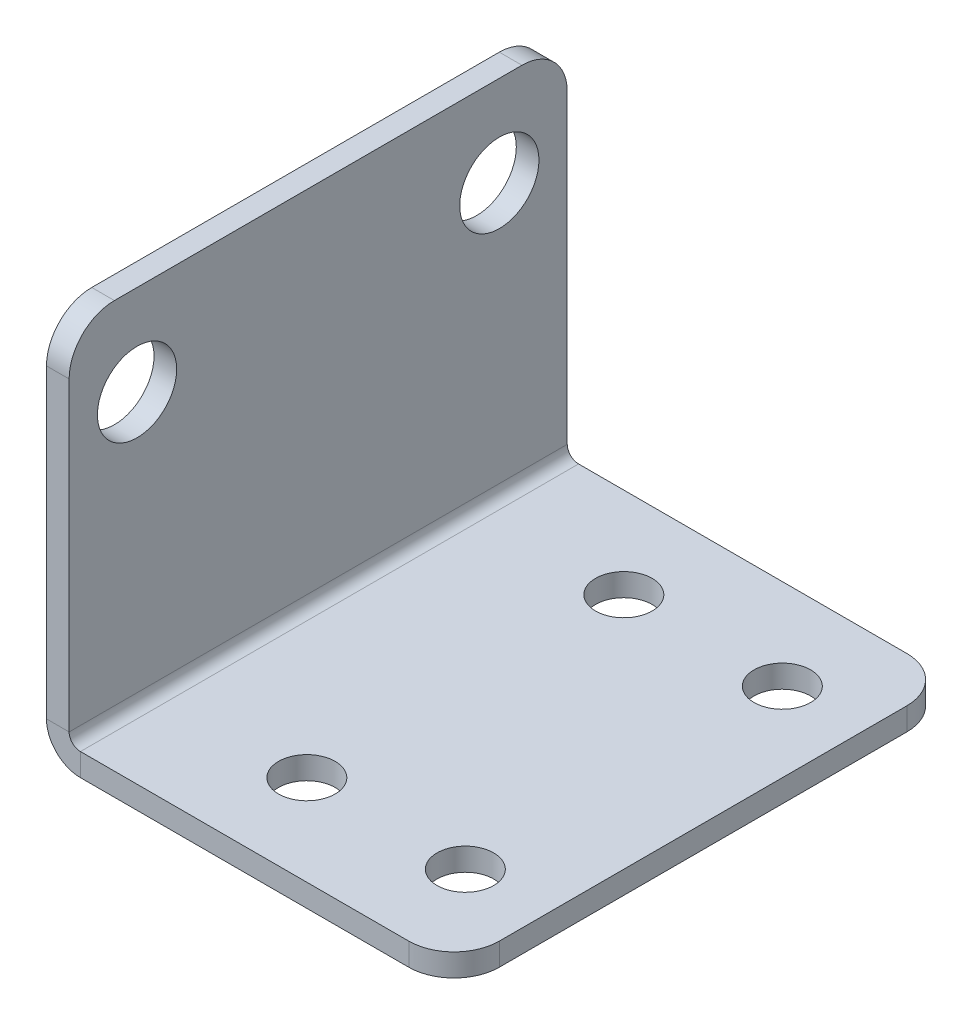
ISO-10303-21;
HEADER;
FILE_DESCRIPTION(('STEP AP214'),'2;1');
FILE_NAME('part.step','',(''),(''),'','','');
FILE_SCHEMA(('AUTOMOTIVE_DESIGN { 1 0 10303 214 1 1 1 1 }'));
ENDSEC;
DATA;
#1=APPLICATION_CONTEXT('core data for automotive mechanical design processes');
#2=APPLICATION_PROTOCOL_DEFINITION('international standard','automotive_design',2000,#1);
#3=PRODUCT_CONTEXT('',#1,'mechanical');
#4=PRODUCT('Part','Part','',(#3));
#5=PRODUCT_RELATED_PRODUCT_CATEGORY('part','',(#4));
#6=PRODUCT_DEFINITION_FORMATION('','',#4);
#7=PRODUCT_DEFINITION_CONTEXT('part definition',#1,'design');
#8=PRODUCT_DEFINITION('design','',#6,#7);
#9=PRODUCT_DEFINITION_SHAPE('','',#8);
#10=(LENGTH_UNIT() NAMED_UNIT(*) SI_UNIT(.MILLI.,.METRE.));
#11=(NAMED_UNIT(*) PLANE_ANGLE_UNIT() SI_UNIT($,.RADIAN.));
#12=(NAMED_UNIT(*) SI_UNIT($,.STERADIAN.) SOLID_ANGLE_UNIT());
#13=UNCERTAINTY_MEASURE_WITH_UNIT(LENGTH_MEASURE(1.E-05),#10,'distance_accuracy_value','');
#14=(GEOMETRIC_REPRESENTATION_CONTEXT(3) GLOBAL_UNCERTAINTY_ASSIGNED_CONTEXT((#13)) GLOBAL_UNIT_ASSIGNED_CONTEXT((#10,
#11,#12)) REPRESENTATION_CONTEXT('',''));
#15=CARTESIAN_POINT('',(0.,0.,0.));
#16=DIRECTION('',(0.,0.,1.));
#17=DIRECTION('',(1.,0.,0.));
#18=AXIS2_PLACEMENT_3D('',#15,#16,#17);
#19=CARTESIAN_POINT('',(0.5,0.,11.));
#20=DIRECTION('',(0.,0.,1.));
#21=DIRECTION('',(1.,0.,0.));
#22=AXIS2_PLACEMENT_3D('',#19,#20,#21);
#23=PLANE('',#22);
#24=DIRECTION('',(0.,-1.,0.));
#25=VECTOR('',#24,1.);
#26=CARTESIAN_POINT('',(0.5,0.,11.));
#27=LINE('',#26,#25);
#28=CARTESIAN_POINT('',(0.5,0.,11.));
#29=VERTEX_POINT('',#28);
#30=CARTESIAN_POINT('',(0.5,-1.,11.));
#31=VERTEX_POINT('',#30);
#32=EDGE_CURVE('E128',#29,#31,#27,.T.);
#33=ORIENTED_EDGE('',*,*,#32,.F.);
#34=CARTESIAN_POINT('',(0.5,0.5,11.));
#35=DIRECTION('',(0.,0.,-1.));
#36=DIRECTION('',(-1.,0.,0.));
#37=AXIS2_PLACEMENT_3D('',#34,#35,#36);
#38=CIRCLE('',#37,0.5);
#39=CARTESIAN_POINT('',(0.,0.5,11.));
#40=VERTEX_POINT('',#39);
#41=EDGE_CURVE('E132',#40,#29,#38,.F.);
#42=ORIENTED_EDGE('',*,*,#41,.F.);
#43=DIRECTION('',(1.,0.,0.));
#44=VECTOR('',#43,1.);
#45=CARTESIAN_POINT('',(-1.,0.500000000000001,11.));
#46=LINE('',#45,#44);
#47=CARTESIAN_POINT('',(-1.,0.500000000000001,11.));
#48=VERTEX_POINT('',#47);
#49=EDGE_CURVE('E140',#48,#40,#46,.T.);
#50=ORIENTED_EDGE('',*,*,#49,.F.);
#51=CARTESIAN_POINT('',(0.5,0.5,11.));
#52=DIRECTION('',(0.,0.,1.));
#53=DIRECTION('',(1.,0.,0.));
#54=AXIS2_PLACEMENT_3D('',#51,#52,#53);
#55=CIRCLE('',#54,1.5);
#56=EDGE_CURVE('E134',#48,#31,#55,.T.);
#57=ORIENTED_EDGE('',*,*,#56,.T.);
#58=EDGE_LOOP('',(#33,#42,#50,#57));
#59=FACE_BOUND('',#58,.T.);
#60=ADVANCED_FACE('F38',(#59),#23,.T.);
#61=CARTESIAN_POINT('',(-1.,0.500000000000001,11.));
#62=DIRECTION('',(0.,0.,1.));
#63=DIRECTION('',(1.,0.,0.));
#64=AXIS2_PLACEMENT_3D('',#61,#62,#63);
#65=PLANE('',#64);
#66=DIRECTION('',(1.,0.,0.));
#67=VECTOR('',#66,1.);
#68=CARTESIAN_POINT('',(0.,-1.,11.));
#69=LINE('',#68,#67);
#70=CARTESIAN_POINT('',(15.,-1.,11.));
#71=VERTEX_POINT('',#70);
#72=EDGE_CURVE('E162',#31,#71,#69,.T.);
#73=ORIENTED_EDGE('',*,*,#72,.T.);
#74=DIRECTION('',(0.,-1.,0.));
#75=VECTOR('',#74,1.);
#76=CARTESIAN_POINT('',(15.,0.500000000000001,11.));
#77=LINE('',#76,#75);
#78=CARTESIAN_POINT('',(15.,0.,11.));
#79=VERTEX_POINT('',#78);
#80=EDGE_CURVE('E161',#71,#79,#77,.F.);
#81=ORIENTED_EDGE('',*,*,#80,.T.);
#82=DIRECTION('',(1.,0.,0.));
#83=VECTOR('',#82,1.);
#84=CARTESIAN_POINT('',(0.,0.,11.));
#85=LINE('',#84,#83);
#86=EDGE_CURVE('E149',#29,#79,#85,.T.);
#87=ORIENTED_EDGE('',*,*,#86,.F.);
#88=ORIENTED_EDGE('',*,*,#32,.T.);
#89=EDGE_LOOP('',(#73,#81,#87,#88));
#90=FACE_BOUND('',#89,.T.);
#91=ADVANCED_FACE('F159',(#90),#65,.T.);
#92=CARTESIAN_POINT('',(0.,0.5,-11.));
#93=DIRECTION('',(0.,0.,-1.));
#94=DIRECTION('',(-1.,0.,0.));
#95=AXIS2_PLACEMENT_3D('',#92,#93,#94);
#96=PLANE('',#95);
#97=DIRECTION('',(-1.,0.,0.));
#98=VECTOR('',#97,1.);
#99=CARTESIAN_POINT('',(0.,0.5,-11.));
#100=LINE('',#99,#98);
#101=CARTESIAN_POINT('',(0.,0.5,-11.));
#102=VERTEX_POINT('',#101);
#103=CARTESIAN_POINT('',(-1.,0.500000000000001,-11.));
#104=VERTEX_POINT('',#103);
#105=EDGE_CURVE('E206',#102,#104,#100,.T.);
#106=ORIENTED_EDGE('',*,*,#105,.F.);
#107=CARTESIAN_POINT('',(0.5,0.5,-11.));
#108=DIRECTION('',(0.,0.,-1.));
#109=DIRECTION('',(-1.,0.,0.));
#110=AXIS2_PLACEMENT_3D('',#107,#108,#109);
#111=CIRCLE('',#110,0.5);
#112=CARTESIAN_POINT('',(0.5,0.,-11.));
#113=VERTEX_POINT('',#112);
#114=EDGE_CURVE('E181',#102,#113,#111,.F.);
#115=ORIENTED_EDGE('',*,*,#114,.T.);
#116=DIRECTION('',(0.,1.,0.));
#117=VECTOR('',#116,1.);
#118=CARTESIAN_POINT('',(0.5,-1.,-11.));
#119=LINE('',#118,#117);
#120=CARTESIAN_POINT('',(0.5,-1.,-11.));
#121=VERTEX_POINT('',#120);
#122=EDGE_CURVE('E204',#121,#113,#119,.T.);
#123=ORIENTED_EDGE('',*,*,#122,.F.);
#124=CARTESIAN_POINT('',(0.5,0.5,-11.));
#125=DIRECTION('',(0.,0.,1.));
#126=DIRECTION('',(1.,0.,0.));
#127=AXIS2_PLACEMENT_3D('',#124,#125,#126);
#128=CIRCLE('',#127,1.5);
#129=EDGE_CURVE('E187',#104,#121,#128,.T.);
#130=ORIENTED_EDGE('',*,*,#129,.F.);
#131=EDGE_LOOP('',(#106,#115,#123,#130));
#132=FACE_BOUND('',#131,.T.);
#133=ADVANCED_FACE('F333',(#132),#96,.T.);
#134=CARTESIAN_POINT('',(0.5,-1.,-11.));
#135=DIRECTION('',(0.,0.,-1.));
#136=DIRECTION('',(-1.,0.,0.));
#137=AXIS2_PLACEMENT_3D('',#134,#135,#136);
#138=PLANE('',#137);
#139=DIRECTION('',(0.,-1.,0.));
#140=VECTOR('',#139,1.);
#141=CARTESIAN_POINT('',(-1.,16.,-11.));
#142=LINE('',#141,#140);
#143=CARTESIAN_POINT('',(-1.,14.,-11.));
#144=VERTEX_POINT('',#143);
#145=EDGE_CURVE('E185',#144,#104,#142,.T.);
#146=ORIENTED_EDGE('',*,*,#145,.F.);
#147=DIRECTION('',(1.,0.,0.));
#148=VECTOR('',#147,1.);
#149=CARTESIAN_POINT('',(0.5,14.,-11.));
#150=LINE('',#149,#148);
#151=CARTESIAN_POINT('',(0.,14.,-11.));
#152=VERTEX_POINT('',#151);
#153=EDGE_CURVE('E232',#144,#152,#150,.T.);
#154=ORIENTED_EDGE('',*,*,#153,.T.);
#155=DIRECTION('',(0.,-1.,0.));
#156=VECTOR('',#155,1.);
#157=CARTESIAN_POINT('',(0.,16.,-11.));
#158=LINE('',#157,#156);
#159=EDGE_CURVE('E183',#152,#102,#158,.T.);
#160=ORIENTED_EDGE('',*,*,#159,.T.);
#161=ORIENTED_EDGE('',*,*,#105,.T.);
#162=EDGE_LOOP('',(#146,#154,#160,#161));
#163=FACE_BOUND('',#162,.T.);
#164=ADVANCED_FACE('F252',(#163),#138,.T.);
#165=CARTESIAN_POINT('',(0.,-1.,11.));
#166=DIRECTION('',(0.,1.,0.));
#167=DIRECTION('',(0.,0.,1.));
#168=AXIS2_PLACEMENT_3D('',#165,#166,#167);
#169=PLANE('',#168);
#170=CARTESIAN_POINT('',(6.5,-1.,-7.));
#171=DIRECTION('',(0.,1.,0.));
#172=DIRECTION('',(0.,0.,1.));
#173=AXIS2_PLACEMENT_3D('',#170,#171,#172);
#174=CIRCLE('',#173,1.24999999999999);
#175=CARTESIAN_POINT('',(6.5,-1.,-5.75000000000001));
#176=VERTEX_POINT('',#175);
#177=EDGE_CURVE('E290',#176,#176,#174,.T.);
#178=ORIENTED_EDGE('',*,*,#177,.T.);
#179=EDGE_LOOP('',(#178));
#180=FACE_BOUND('',#179,.T.);
#181=CARTESIAN_POINT('',(13.5,-1.,-7.));
#182=DIRECTION('',(0.,1.,0.));
#183=DIRECTION('',(0.,0.,1.));
#184=AXIS2_PLACEMENT_3D('',#181,#182,#183);
#185=CIRCLE('',#184,1.24999999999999);
#186=CARTESIAN_POINT('',(13.5,-1.,-5.75000000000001));
#187=VERTEX_POINT('',#186);
#188=EDGE_CURVE('E284',#187,#187,#185,.T.);
#189=ORIENTED_EDGE('',*,*,#188,.T.);
#190=EDGE_LOOP('',(#189));
#191=FACE_BOUND('',#190,.T.);
#192=CARTESIAN_POINT('',(6.5,-1.,7.));
#193=DIRECTION('',(0.,1.,0.));
#194=DIRECTION('',(0.,0.,1.));
#195=AXIS2_PLACEMENT_3D('',#192,#193,#194);
#196=CIRCLE('',#195,1.24999999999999);
#197=CARTESIAN_POINT('',(6.5,-1.,8.24999999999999));
#198=VERTEX_POINT('',#197);
#199=EDGE_CURVE('E278',#198,#198,#196,.T.);
#200=ORIENTED_EDGE('',*,*,#199,.T.);
#201=EDGE_LOOP('',(#200));
#202=FACE_BOUND('',#201,.T.);
#203=CARTESIAN_POINT('',(13.5,-1.,7.));
#204=DIRECTION('',(0.,1.,0.));
#205=DIRECTION('',(0.,0.,1.));
#206=AXIS2_PLACEMENT_3D('',#203,#204,#205);
#207=CIRCLE('',#206,1.24999999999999);
#208=CARTESIAN_POINT('',(13.5,-1.,8.24999999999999));
#209=VERTEX_POINT('',#208);
#210=EDGE_CURVE('E179',#209,#209,#207,.T.);
#211=ORIENTED_EDGE('',*,*,#210,.T.);
#212=EDGE_LOOP('',(#211));
#213=FACE_BOUND('',#212,.T.);
#214=DIRECTION('',(1.,0.,0.));
#215=VECTOR('',#214,1.);
#216=CARTESIAN_POINT('',(0.,-1.,-11.));
#217=LINE('',#216,#215);
#218=CARTESIAN_POINT('',(15.,-1.,-11.));
#219=VERTEX_POINT('',#218);
#220=EDGE_CURVE('E176',#121,#219,#217,.T.);
#221=ORIENTED_EDGE('',*,*,#220,.T.);
#222=CARTESIAN_POINT('',(15.,-1.,-9.));
#223=DIRECTION('',(0.,1.,0.));
#224=DIRECTION('',(0.,0.,1.));
#225=AXIS2_PLACEMENT_3D('',#222,#223,#224);
#226=CIRCLE('',#225,2.);
#227=CARTESIAN_POINT('',(17.,-1.,-9.));
#228=VERTEX_POINT('',#227);
#229=EDGE_CURVE('E220',#219,#228,#226,.F.);
#230=ORIENTED_EDGE('',*,*,#229,.T.);
#231=DIRECTION('',(0.,0.,-1.));
#232=VECTOR('',#231,1.);
#233=CARTESIAN_POINT('',(17.,-1.,11.));
#234=LINE('',#233,#232);
#235=CARTESIAN_POINT('',(17.,-1.,9.));
#236=VERTEX_POINT('',#235);
#237=EDGE_CURVE('E201',#236,#228,#234,.T.);
#238=ORIENTED_EDGE('',*,*,#237,.F.);
#239=CARTESIAN_POINT('',(15.,-1.,9.));
#240=DIRECTION('',(0.,1.,0.));
#241=DIRECTION('',(0.,0.,1.));
#242=AXIS2_PLACEMENT_3D('',#239,#240,#241);
#243=CIRCLE('',#242,2.);
#244=EDGE_CURVE('E218',#236,#71,#243,.F.);
#245=ORIENTED_EDGE('',*,*,#244,.T.);
#246=ORIENTED_EDGE('',*,*,#72,.F.);
#247=DIRECTION('',(0.,0.,-1.));
#248=VECTOR('',#247,1.);
#249=CARTESIAN_POINT('',(0.5,-1.,11.));
#250=LINE('',#249,#248);
#251=EDGE_CURVE('E175',#31,#121,#250,.T.);
#252=ORIENTED_EDGE('',*,*,#251,.T.);
#253=EDGE_LOOP('',(#221,#230,#238,#245,#246,#252));
#254=FACE_BOUND('',#253,.T.);
#255=ADVANCED_FACE('F270',(#180,#191,#202,#213,#254),#169,.F.);
#256=CARTESIAN_POINT('',(17.,0.,11.));
#257=DIRECTION('',(1.,0.,0.));
#258=DIRECTION('',(0.,0.,-1.));
#259=AXIS2_PLACEMENT_3D('',#256,#257,#258);
#260=PLANE('',#259);
#261=ORIENTED_EDGE('',*,*,#237,.T.);
#262=DIRECTION('',(0.,-1.,0.));
#263=VECTOR('',#262,1.);
#264=CARTESIAN_POINT('',(17.,0.,-9.));
#265=LINE('',#264,#263);
#266=CARTESIAN_POINT('',(17.,0.,-9.));
#267=VERTEX_POINT('',#266);
#268=EDGE_CURVE('E225',#228,#267,#265,.F.);
#269=ORIENTED_EDGE('',*,*,#268,.T.);
#270=DIRECTION('',(0.,0.,-1.));
#271=VECTOR('',#270,1.);
#272=CARTESIAN_POINT('',(17.,0.,11.));
#273=LINE('',#272,#271);
#274=CARTESIAN_POINT('',(17.,0.,9.));
#275=VERTEX_POINT('',#274);
#276=EDGE_CURVE('E156',#275,#267,#273,.T.);
#277=ORIENTED_EDGE('',*,*,#276,.F.);
#278=DIRECTION('',(0.,-1.,0.));
#279=VECTOR('',#278,1.);
#280=CARTESIAN_POINT('',(17.,0.,9.));
#281=LINE('',#280,#279);
#282=EDGE_CURVE('E222',#275,#236,#281,.T.);
#283=ORIENTED_EDGE('',*,*,#282,.T.);
#284=EDGE_LOOP('',(#261,#269,#277,#283));
#285=FACE_BOUND('',#284,.T.);
#286=ADVANCED_FACE('F422',(#285),#260,.T.);
#287=CARTESIAN_POINT('',(0.,0.,11.));
#288=DIRECTION('',(0.,1.,0.));
#289=DIRECTION('',(0.,0.,1.));
#290=AXIS2_PLACEMENT_3D('',#287,#288,#289);
#291=PLANE('',#290);
#292=CARTESIAN_POINT('',(6.5,0.,-7.));
#293=DIRECTION('',(0.,1.,0.));
#294=DIRECTION('',(0.,0.,1.));
#295=AXIS2_PLACEMENT_3D('',#292,#293,#294);
#296=CIRCLE('',#295,1.24999999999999);
#297=CARTESIAN_POINT('',(6.5,0.,-5.75000000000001));
#298=VERTEX_POINT('',#297);
#299=EDGE_CURVE('E293',#298,#298,#296,.T.);
#300=ORIENTED_EDGE('',*,*,#299,.F.);
#301=EDGE_LOOP('',(#300));
#302=FACE_BOUND('',#301,.T.);
#303=CARTESIAN_POINT('',(13.5,0.,-7.));
#304=DIRECTION('',(0.,1.,0.));
#305=DIRECTION('',(0.,0.,1.));
#306=AXIS2_PLACEMENT_3D('',#303,#304,#305);
#307=CIRCLE('',#306,1.24999999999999);
#308=CARTESIAN_POINT('',(13.5,0.,-5.75000000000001));
#309=VERTEX_POINT('',#308);
#310=EDGE_CURVE('E287',#309,#309,#307,.T.);
#311=ORIENTED_EDGE('',*,*,#310,.F.);
#312=EDGE_LOOP('',(#311));
#313=FACE_BOUND('',#312,.T.);
#314=CARTESIAN_POINT('',(6.5,0.,7.));
#315=DIRECTION('',(0.,1.,0.));
#316=DIRECTION('',(0.,0.,1.));
#317=AXIS2_PLACEMENT_3D('',#314,#315,#316);
#318=CIRCLE('',#317,1.24999999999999);
#319=CARTESIAN_POINT('',(6.5,0.,8.24999999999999));
#320=VERTEX_POINT('',#319);
#321=EDGE_CURVE('E281',#320,#320,#318,.T.);
#322=ORIENTED_EDGE('',*,*,#321,.F.);
#323=EDGE_LOOP('',(#322));
#324=FACE_BOUND('',#323,.T.);
#325=CARTESIAN_POINT('',(13.5,0.,7.));
#326=DIRECTION('',(0.,1.,0.));
#327=DIRECTION('',(0.,0.,1.));
#328=AXIS2_PLACEMENT_3D('',#325,#326,#327);
#329=CIRCLE('',#328,1.24999999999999);
#330=CARTESIAN_POINT('',(13.5,0.,8.24999999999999));
#331=VERTEX_POINT('',#330);
#332=EDGE_CURVE('E275',#331,#331,#329,.T.);
#333=ORIENTED_EDGE('',*,*,#332,.F.);
#334=EDGE_LOOP('',(#333));
#335=FACE_BOUND('',#334,.T.);
#336=ORIENTED_EDGE('',*,*,#276,.T.);
#337=CARTESIAN_POINT('',(15.,0.,-9.));
#338=DIRECTION('',(0.,1.,0.));
#339=DIRECTION('',(0.,0.,1.));
#340=AXIS2_PLACEMENT_3D('',#337,#338,#339);
#341=CIRCLE('',#340,2.);
#342=CARTESIAN_POINT('',(15.,0.,-11.));
#343=VERTEX_POINT('',#342);
#344=EDGE_CURVE('E229',#267,#343,#341,.T.);
#345=ORIENTED_EDGE('',*,*,#344,.T.);
#346=DIRECTION('',(1.,0.,0.));
#347=VECTOR('',#346,1.);
#348=CARTESIAN_POINT('',(0.,0.,-11.));
#349=LINE('',#348,#347);
#350=EDGE_CURVE('E152',#113,#343,#349,.T.);
#351=ORIENTED_EDGE('',*,*,#350,.F.);
#352=DIRECTION('',(0.,0.,-1.));
#353=VECTOR('',#352,1.);
#354=CARTESIAN_POINT('',(0.5,0.,11.));
#355=LINE('',#354,#353);
#356=EDGE_CURVE('E146',#29,#113,#355,.T.);
#357=ORIENTED_EDGE('',*,*,#356,.F.);
#358=ORIENTED_EDGE('',*,*,#86,.T.);
#359=CARTESIAN_POINT('',(15.,0.,9.));
#360=DIRECTION('',(0.,1.,0.));
#361=DIRECTION('',(0.,0.,1.));
#362=AXIS2_PLACEMENT_3D('',#359,#360,#361);
#363=CIRCLE('',#362,2.);
#364=EDGE_CURVE('E227',#79,#275,#363,.T.);
#365=ORIENTED_EDGE('',*,*,#364,.T.);
#366=EDGE_LOOP('',(#336,#345,#351,#357,#358,#365));
#367=FACE_BOUND('',#366,.T.);
#368=ADVANCED_FACE('F148',(#302,#313,#324,#335,#367),#291,.T.);
#369=CARTESIAN_POINT('',(0.5,0.5,11.));
#370=DIRECTION('',(0.,0.,-1.));
#371=DIRECTION('',(-1.,0.,0.));
#372=AXIS2_PLACEMENT_3D('',#369,#370,#371);
#373=CYLINDRICAL_SURFACE('',#372,0.5);
#374=ORIENTED_EDGE('',*,*,#114,.F.);
#375=DIRECTION('',(0.,0.,-1.));
#376=VECTOR('',#375,1.);
#377=CARTESIAN_POINT('',(0.,0.5,11.));
#378=LINE('',#377,#376);
#379=EDGE_CURVE('E157',#40,#102,#378,.T.);
#380=ORIENTED_EDGE('',*,*,#379,.F.);
#381=ORIENTED_EDGE('',*,*,#41,.T.);
#382=ORIENTED_EDGE('',*,*,#356,.T.);
#383=EDGE_LOOP('',(#374,#380,#381,#382));
#384=FACE_BOUND('',#383,.T.);
#385=ADVANCED_FACE('F165',(#384),#373,.F.);
#386=CARTESIAN_POINT('',(0.,16.,11.));
#387=DIRECTION('',(1.,0.,0.));
#388=DIRECTION('',(0.,1.,0.));
#389=AXIS2_PLACEMENT_3D('',#386,#387,#388);
#390=PLANE('',#389);
#391=CARTESIAN_POINT('',(0.,12.,8.));
#392=DIRECTION('',(1.,0.,0.));
#393=DIRECTION('',(0.,0.,-1.));
#394=AXIS2_PLACEMENT_3D('',#391,#392,#393);
#395=CIRCLE('',#394,1.75);
#396=CARTESIAN_POINT('',(0.,12.,6.25));
#397=VERTEX_POINT('',#396);
#398=EDGE_CURVE('E215',#397,#397,#395,.T.);
#399=ORIENTED_EDGE('',*,*,#398,.F.);
#400=EDGE_LOOP('',(#399));
#401=FACE_BOUND('',#400,.T.);
#402=CARTESIAN_POINT('',(0.,12.,-8.));
#403=DIRECTION('',(1.,0.,0.));
#404=DIRECTION('',(0.,0.,-1.));
#405=AXIS2_PLACEMENT_3D('',#402,#403,#404);
#406=CIRCLE('',#405,1.75);
#407=CARTESIAN_POINT('',(0.,12.,-9.75));
#408=VERTEX_POINT('',#407);
#409=EDGE_CURVE('E214',#408,#408,#406,.T.);
#410=ORIENTED_EDGE('',*,*,#409,.F.);
#411=EDGE_LOOP('',(#410));
#412=FACE_BOUND('',#411,.T.);
#413=ORIENTED_EDGE('',*,*,#159,.F.);
#414=CARTESIAN_POINT('',(0.,14.,-9.));
#415=DIRECTION('',(1.,0.,0.));
#416=DIRECTION('',(0.,1.,0.));
#417=AXIS2_PLACEMENT_3D('',#414,#415,#416);
#418=CIRCLE('',#417,2.);
#419=CARTESIAN_POINT('',(0.,16.,-9.));
#420=VERTEX_POINT('',#419);
#421=EDGE_CURVE('E237',#152,#420,#418,.T.);
#422=ORIENTED_EDGE('',*,*,#421,.T.);
#423=DIRECTION('',(0.,0.,-1.));
#424=VECTOR('',#423,1.);
#425=CARTESIAN_POINT('',(0.,16.,11.));
#426=LINE('',#425,#424);
#427=CARTESIAN_POINT('',(0.,16.,9.));
#428=VERTEX_POINT('',#427);
#429=EDGE_CURVE('E197',#428,#420,#426,.T.);
#430=ORIENTED_EDGE('',*,*,#429,.F.);
#431=CARTESIAN_POINT('',(0.,14.,9.));
#432=DIRECTION('',(1.,0.,0.));
#433=DIRECTION('',(0.,1.,0.));
#434=AXIS2_PLACEMENT_3D('',#431,#432,#433);
#435=CIRCLE('',#434,2.);
#436=CARTESIAN_POINT('',(0.,14.,11.));
#437=VERTEX_POINT('',#436);
#438=EDGE_CURVE('E235',#428,#437,#435,.T.);
#439=ORIENTED_EDGE('',*,*,#438,.T.);
#440=DIRECTION('',(0.,-1.,0.));
#441=VECTOR('',#440,1.);
#442=CARTESIAN_POINT('',(0.,16.,11.));
#443=LINE('',#442,#441);
#444=EDGE_CURVE('E167',#437,#40,#443,.T.);
#445=ORIENTED_EDGE('',*,*,#444,.T.);
#446=ORIENTED_EDGE('',*,*,#379,.T.);
#447=EDGE_LOOP('',(#413,#422,#430,#439,#445,#446));
#448=FACE_BOUND('',#447,.T.);
#449=ADVANCED_FACE('F258',(#401,#412,#448),#390,.T.);
#450=CARTESIAN_POINT('',(-1.,16.,11.));
#451=DIRECTION('',(0.,1.,0.));
#452=DIRECTION('',(0.,0.,1.));
#453=AXIS2_PLACEMENT_3D('',#450,#451,#452);
#454=PLANE('',#453);
#455=ORIENTED_EDGE('',*,*,#429,.T.);
#456=DIRECTION('',(1.,0.,0.));
#457=VECTOR('',#456,1.);
#458=CARTESIAN_POINT('',(-1.,16.,-9.));
#459=LINE('',#458,#457);
#460=CARTESIAN_POINT('',(-1.,16.,-9.));
#461=VERTEX_POINT('',#460);
#462=EDGE_CURVE('E59',#420,#461,#459,.F.);
#463=ORIENTED_EDGE('',*,*,#462,.T.);
#464=DIRECTION('',(0.,0.,-1.));
#465=VECTOR('',#464,1.);
#466=CARTESIAN_POINT('',(-1.,16.,11.));
#467=LINE('',#466,#465);
#468=CARTESIAN_POINT('',(-1.,16.,9.));
#469=VERTEX_POINT('',#468);
#470=EDGE_CURVE('E195',#469,#461,#467,.T.);
#471=ORIENTED_EDGE('',*,*,#470,.F.);
#472=DIRECTION('',(1.,0.,0.));
#473=VECTOR('',#472,1.);
#474=CARTESIAN_POINT('',(0.,16.,9.));
#475=LINE('',#474,#473);
#476=EDGE_CURVE('E239',#469,#428,#475,.T.);
#477=ORIENTED_EDGE('',*,*,#476,.T.);
#478=EDGE_LOOP('',(#455,#463,#471,#477));
#479=FACE_BOUND('',#478,.T.);
#480=ADVANCED_FACE('F259',(#479),#454,.T.);
#481=CARTESIAN_POINT('',(-1.,16.,11.));
#482=DIRECTION('',(1.,0.,0.));
#483=DIRECTION('',(0.,1.,0.));
#484=AXIS2_PLACEMENT_3D('',#481,#482,#483);
#485=PLANE('',#484);
#486=CARTESIAN_POINT('',(-1.,12.,8.));
#487=DIRECTION('',(1.,0.,0.));
#488=DIRECTION('',(0.,1.,0.));
#489=AXIS2_PLACEMENT_3D('',#486,#487,#488);
#490=CIRCLE('',#489,1.75);
#491=CARTESIAN_POINT('',(-1.,13.75,8.));
#492=VERTEX_POINT('',#491);
#493=EDGE_CURVE('E211',#492,#492,#490,.T.);
#494=ORIENTED_EDGE('',*,*,#493,.T.);
#495=EDGE_LOOP('',(#494));
#496=FACE_BOUND('',#495,.T.);
#497=CARTESIAN_POINT('',(-1.,12.,-8.));
#498=DIRECTION('',(1.,0.,0.));
#499=DIRECTION('',(0.,1.,0.));
#500=AXIS2_PLACEMENT_3D('',#497,#498,#499);
#501=CIRCLE('',#500,1.75);
#502=CARTESIAN_POINT('',(-1.,13.75,-8.));
#503=VERTEX_POINT('',#502);
#504=EDGE_CURVE('E296',#503,#503,#501,.T.);
#505=ORIENTED_EDGE('',*,*,#504,.T.);
#506=EDGE_LOOP('',(#505));
#507=FACE_BOUND('',#506,.T.);
#508=ORIENTED_EDGE('',*,*,#470,.T.);
#509=CARTESIAN_POINT('',(-1.,14.,-9.));
#510=DIRECTION('',(1.,0.,0.));
#511=DIRECTION('',(0.,1.,0.));
#512=AXIS2_PLACEMENT_3D('',#509,#510,#511);
#513=CIRCLE('',#512,2.);
#514=EDGE_CURVE('E46',#461,#144,#513,.F.);
#515=ORIENTED_EDGE('',*,*,#514,.T.);
#516=ORIENTED_EDGE('',*,*,#145,.T.);
#517=DIRECTION('',(0.,0.,-1.));
#518=VECTOR('',#517,1.);
#519=CARTESIAN_POINT('',(-1.,0.500000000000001,11.));
#520=LINE('',#519,#518);
#521=EDGE_CURVE('E192',#48,#104,#520,.T.);
#522=ORIENTED_EDGE('',*,*,#521,.F.);
#523=DIRECTION('',(0.,-1.,0.));
#524=VECTOR('',#523,1.);
#525=CARTESIAN_POINT('',(-1.,16.,11.));
#526=LINE('',#525,#524);
#527=CARTESIAN_POINT('',(-1.,14.,11.));
#528=VERTEX_POINT('',#527);
#529=EDGE_CURVE('E169',#528,#48,#526,.T.);
#530=ORIENTED_EDGE('',*,*,#529,.F.);
#531=CARTESIAN_POINT('',(-1.,14.,9.));
#532=DIRECTION('',(1.,0.,0.));
#533=DIRECTION('',(0.,1.,0.));
#534=AXIS2_PLACEMENT_3D('',#531,#532,#533);
#535=CIRCLE('',#534,2.);
#536=EDGE_CURVE('E243',#528,#469,#535,.F.);
#537=ORIENTED_EDGE('',*,*,#536,.T.);
#538=EDGE_LOOP('',(#508,#515,#516,#522,#530,#537));
#539=FACE_BOUND('',#538,.T.);
#540=ADVANCED_FACE('F247',(#496,#507,#539),#485,.F.);
#541=CARTESIAN_POINT('',(0.5,0.5,11.));
#542=DIRECTION('',(0.,0.,-1.));
#543=DIRECTION('',(-1.,0.,0.));
#544=AXIS2_PLACEMENT_3D('',#541,#542,#543);
#545=CYLINDRICAL_SURFACE('',#544,1.5);
#546=ORIENTED_EDGE('',*,*,#129,.T.);
#547=ORIENTED_EDGE('',*,*,#251,.F.);
#548=ORIENTED_EDGE('',*,*,#56,.F.);
#549=ORIENTED_EDGE('',*,*,#521,.T.);
#550=EDGE_LOOP('',(#546,#547,#548,#549));
#551=FACE_BOUND('',#550,.T.);
#552=ADVANCED_FACE('F266',(#551),#545,.T.);
#553=CARTESIAN_POINT('',(0.5,0.5,11.));
#554=DIRECTION('',(0.,0.,-1.));
#555=DIRECTION('',(-1.,0.,0.));
#556=AXIS2_PLACEMENT_3D('',#553,#554,#555);
#557=PLANE('',#556);
#558=ORIENTED_EDGE('',*,*,#444,.F.);
#559=DIRECTION('',(1.,0.,0.));
#560=VECTOR('',#559,1.);
#561=CARTESIAN_POINT('',(-1.,14.,11.));
#562=LINE('',#561,#560);
#563=EDGE_CURVE('E11',#437,#528,#562,.F.);
#564=ORIENTED_EDGE('',*,*,#563,.T.);
#565=ORIENTED_EDGE('',*,*,#529,.T.);
#566=ORIENTED_EDGE('',*,*,#49,.T.);
#567=EDGE_LOOP('',(#558,#564,#565,#566));
#568=FACE_BOUND('',#567,.T.);
#569=ADVANCED_FACE('F263',(#568),#557,.F.);
#570=CARTESIAN_POINT('',(0.5,0.5,-11.));
#571=DIRECTION('',(0.,0.,-1.));
#572=DIRECTION('',(-1.,0.,0.));
#573=AXIS2_PLACEMENT_3D('',#570,#571,#572);
#574=PLANE('',#573);
#575=ORIENTED_EDGE('',*,*,#350,.T.);
#576=DIRECTION('',(0.,-1.,0.));
#577=VECTOR('',#576,1.);
#578=CARTESIAN_POINT('',(15.,0.5,-11.));
#579=LINE('',#578,#577);
#580=EDGE_CURVE('E139',#343,#219,#579,.T.);
#581=ORIENTED_EDGE('',*,*,#580,.T.);
#582=ORIENTED_EDGE('',*,*,#220,.F.);
#583=ORIENTED_EDGE('',*,*,#122,.T.);
#584=EDGE_LOOP('',(#575,#581,#582,#583));
#585=FACE_BOUND('',#584,.T.);
#586=ADVANCED_FACE('F373',(#585),#574,.T.);
#587=CARTESIAN_POINT('',(13.5,0.,7.));
#588=DIRECTION('',(0.,1.,0.));
#589=DIRECTION('',(0.,0.,1.));
#590=AXIS2_PLACEMENT_3D('',#587,#588,#589);
#591=CYLINDRICAL_SURFACE('',#590,1.24999999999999);
#592=ORIENTED_EDGE('',*,*,#332,.T.);
#593=EDGE_LOOP('',(#592));
#594=FACE_BOUND('',#593,.T.);
#595=ORIENTED_EDGE('',*,*,#210,.F.);
#596=EDGE_LOOP('',(#595));
#597=FACE_BOUND('',#596,.T.);
#598=ADVANCED_FACE('F378',(#594,#597),#591,.F.);
#599=CARTESIAN_POINT('',(6.5,0.,7.));
#600=DIRECTION('',(0.,1.,0.));
#601=DIRECTION('',(0.,0.,1.));
#602=AXIS2_PLACEMENT_3D('',#599,#600,#601);
#603=CYLINDRICAL_SURFACE('',#602,1.24999999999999);
#604=ORIENTED_EDGE('',*,*,#321,.T.);
#605=EDGE_LOOP('',(#604));
#606=FACE_BOUND('',#605,.T.);
#607=ORIENTED_EDGE('',*,*,#199,.F.);
#608=EDGE_LOOP('',(#607));
#609=FACE_BOUND('',#608,.T.);
#610=ADVANCED_FACE('F496',(#606,#609),#603,.F.);
#611=CARTESIAN_POINT('',(13.5,0.,-7.));
#612=DIRECTION('',(0.,1.,0.));
#613=DIRECTION('',(0.,0.,1.));
#614=AXIS2_PLACEMENT_3D('',#611,#612,#613);
#615=CYLINDRICAL_SURFACE('',#614,1.24999999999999);
#616=ORIENTED_EDGE('',*,*,#310,.T.);
#617=EDGE_LOOP('',(#616));
#618=FACE_BOUND('',#617,.T.);
#619=ORIENTED_EDGE('',*,*,#188,.F.);
#620=EDGE_LOOP('',(#619));
#621=FACE_BOUND('',#620,.T.);
#622=ADVANCED_FACE('F485',(#618,#621),#615,.F.);
#623=CARTESIAN_POINT('',(6.5,0.,-7.));
#624=DIRECTION('',(0.,1.,0.));
#625=DIRECTION('',(0.,0.,1.));
#626=AXIS2_PLACEMENT_3D('',#623,#624,#625);
#627=CYLINDRICAL_SURFACE('',#626,1.24999999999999);
#628=ORIENTED_EDGE('',*,*,#299,.T.);
#629=EDGE_LOOP('',(#628));
#630=FACE_BOUND('',#629,.T.);
#631=ORIENTED_EDGE('',*,*,#177,.F.);
#632=EDGE_LOOP('',(#631));
#633=FACE_BOUND('',#632,.T.);
#634=ADVANCED_FACE('F315',(#630,#633),#627,.F.);
#635=CARTESIAN_POINT('',(0.,12.,-8.));
#636=DIRECTION('',(1.,0.,0.));
#637=DIRECTION('',(0.,0.,-1.));
#638=AXIS2_PLACEMENT_3D('',#635,#636,#637);
#639=CYLINDRICAL_SURFACE('',#638,1.75);
#640=ORIENTED_EDGE('',*,*,#409,.T.);
#641=EDGE_LOOP('',(#640));
#642=FACE_BOUND('',#641,.T.);
#643=ORIENTED_EDGE('',*,*,#504,.F.);
#644=EDGE_LOOP('',(#643));
#645=FACE_BOUND('',#644,.T.);
#646=ADVANCED_FACE('F312',(#642,#645),#639,.F.);
#647=CARTESIAN_POINT('',(0.,12.,8.));
#648=DIRECTION('',(1.,0.,0.));
#649=DIRECTION('',(0.,0.,-1.));
#650=AXIS2_PLACEMENT_3D('',#647,#648,#649);
#651=CYLINDRICAL_SURFACE('',#650,1.75);
#652=ORIENTED_EDGE('',*,*,#398,.T.);
#653=EDGE_LOOP('',(#652));
#654=FACE_BOUND('',#653,.T.);
#655=ORIENTED_EDGE('',*,*,#493,.F.);
#656=EDGE_LOOP('',(#655));
#657=FACE_BOUND('',#656,.T.);
#658=ADVANCED_FACE('F304',(#654,#657),#651,.F.);
#659=CARTESIAN_POINT('',(15.,0.5,-9.));
#660=DIRECTION('',(0.,-1.,0.));
#661=DIRECTION('',(0.,0.,-1.));
#662=AXIS2_PLACEMENT_3D('',#659,#660,#661);
#663=CYLINDRICAL_SURFACE('',#662,2.);
#664=ORIENTED_EDGE('',*,*,#344,.F.);
#665=ORIENTED_EDGE('',*,*,#268,.F.);
#666=ORIENTED_EDGE('',*,*,#229,.F.);
#667=ORIENTED_EDGE('',*,*,#580,.F.);
#668=EDGE_LOOP('',(#664,#665,#666,#667));
#669=FACE_BOUND('',#668,.T.);
#670=ADVANCED_FACE('F337',(#669),#663,.T.);
#671=CARTESIAN_POINT('',(15.,0.,9.));
#672=DIRECTION('',(0.,-1.,0.));
#673=DIRECTION('',(0.,0.,-1.));
#674=AXIS2_PLACEMENT_3D('',#671,#672,#673);
#675=CYLINDRICAL_SURFACE('',#674,2.);
#676=ORIENTED_EDGE('',*,*,#364,.F.);
#677=ORIENTED_EDGE('',*,*,#80,.F.);
#678=ORIENTED_EDGE('',*,*,#244,.F.);
#679=ORIENTED_EDGE('',*,*,#282,.F.);
#680=EDGE_LOOP('',(#676,#677,#678,#679));
#681=FACE_BOUND('',#680,.T.);
#682=ADVANCED_FACE('F340',(#681),#675,.T.);
#683=CARTESIAN_POINT('',(0.5,14.,-9.));
#684=DIRECTION('',(1.,0.,0.));
#685=DIRECTION('',(0.,0.,-1.));
#686=AXIS2_PLACEMENT_3D('',#683,#684,#685);
#687=CYLINDRICAL_SURFACE('',#686,2.);
#688=ORIENTED_EDGE('',*,*,#514,.F.);
#689=ORIENTED_EDGE('',*,*,#462,.F.);
#690=ORIENTED_EDGE('',*,*,#421,.F.);
#691=ORIENTED_EDGE('',*,*,#153,.F.);
#692=EDGE_LOOP('',(#688,#689,#690,#691));
#693=FACE_BOUND('',#692,.T.);
#694=ADVANCED_FACE('F255',(#693),#687,.T.);
#695=CARTESIAN_POINT('',(-1.,14.,9.));
#696=DIRECTION('',(-1.,0.,0.));
#697=DIRECTION('',(0.,0.,1.));
#698=AXIS2_PLACEMENT_3D('',#695,#696,#697);
#699=CYLINDRICAL_SURFACE('',#698,2.);
#700=ORIENTED_EDGE('',*,*,#536,.F.);
#701=ORIENTED_EDGE('',*,*,#563,.F.);
#702=ORIENTED_EDGE('',*,*,#438,.F.);
#703=ORIENTED_EDGE('',*,*,#476,.F.);
#704=EDGE_LOOP('',(#700,#701,#702,#703));
#705=FACE_BOUND('',#704,.T.);
#706=ADVANCED_FACE('F40',(#705),#699,.T.);
#707=CLOSED_SHELL('',(#60,#91,#133,#164,#255,#286,#368,#385,#449,#480,#540,#552,#569,#586,#598,
#610,#622,#634,#646,#658,#670,#682,#694,#706));
#708=MANIFOLD_SOLID_BREP('B2',#707);
#709=ADVANCED_BREP_SHAPE_REPRESENTATION('',(#18,#708),#14);
#710=SHAPE_DEFINITION_REPRESENTATION(#9,#709);
ENDSEC;
END-ISO-10303-21;
